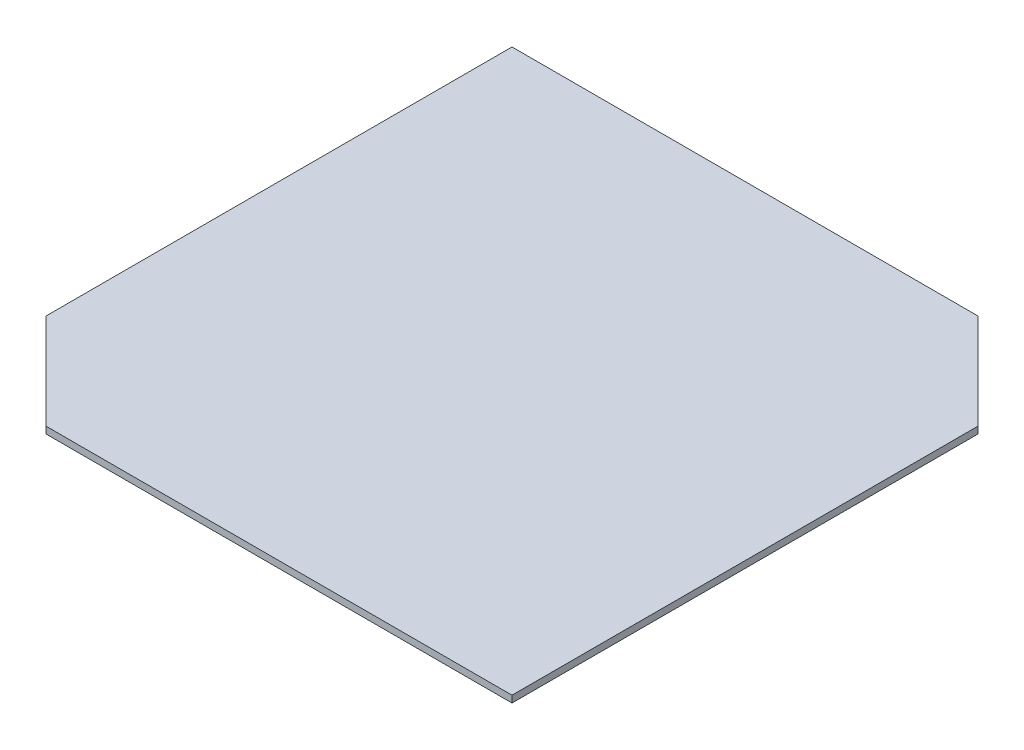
ISO-10303-21;
HEADER;
FILE_DESCRIPTION(('STEP AP214'),'2;1');
FILE_NAME('part.step','',(''),(''),'','','');
FILE_SCHEMA(('AUTOMOTIVE_DESIGN { 1 0 10303 214 1 1 1 1 }'));
ENDSEC;
DATA;
#1=APPLICATION_CONTEXT('core data for automotive mechanical design processes');
#2=APPLICATION_PROTOCOL_DEFINITION('international standard','automotive_design',2000,#1);
#3=PRODUCT_CONTEXT('',#1,'mechanical');
#4=PRODUCT('Part','Part','',(#3));
#5=PRODUCT_RELATED_PRODUCT_CATEGORY('part','',(#4));
#6=PRODUCT_DEFINITION_FORMATION('','',#4);
#7=PRODUCT_DEFINITION_CONTEXT('part definition',#1,'design');
#8=PRODUCT_DEFINITION('design','',#6,#7);
#9=PRODUCT_DEFINITION_SHAPE('','',#8);
#10=(LENGTH_UNIT() NAMED_UNIT(*) SI_UNIT(.MILLI.,.METRE.));
#11=(NAMED_UNIT(*) PLANE_ANGLE_UNIT() SI_UNIT($,.RADIAN.));
#12=(NAMED_UNIT(*) SI_UNIT($,.STERADIAN.) SOLID_ANGLE_UNIT());
#13=UNCERTAINTY_MEASURE_WITH_UNIT(LENGTH_MEASURE(1.E-05),#10,'distance_accuracy_value','');
#14=(GEOMETRIC_REPRESENTATION_CONTEXT(3) GLOBAL_UNCERTAINTY_ASSIGNED_CONTEXT((#13)) GLOBAL_UNIT_ASSIGNED_CONTEXT((#10,
#11,#12)) REPRESENTATION_CONTEXT('',''));
#15=CARTESIAN_POINT('',(0.,0.,0.));
#16=DIRECTION('',(0.,0.,1.));
#17=DIRECTION('',(1.,0.,0.));
#18=AXIS2_PLACEMENT_3D('',#15,#16,#17);
#19=CARTESIAN_POINT('',(-206.,5.,206.));
#20=DIRECTION('',(1.,0.,0.));
#21=DIRECTION('',(0.,0.,-1.));
#22=AXIS2_PLACEMENT_3D('',#19,#20,#21);
#23=PLANE('',#22);
#24=DIRECTION('',(0.,0.,1.));
#25=VECTOR('',#24,1.);
#26=CARTESIAN_POINT('',(-206.,0.,206.));
#27=LINE('',#26,#25);
#28=CARTESIAN_POINT('',(-206.,0.,-206.));
#29=VERTEX_POINT('',#28);
#30=CARTESIAN_POINT('',(-206.,0.,136.));
#31=VERTEX_POINT('',#30);
#32=EDGE_CURVE('E117',#29,#31,#27,.T.);
#33=ORIENTED_EDGE('',*,*,#32,.T.);
#34=DIRECTION('',(0.,1.,0.));
#35=VECTOR('',#34,1.);
#36=CARTESIAN_POINT('',(-206.,5.,136.));
#37=LINE('',#36,#35);
#38=CARTESIAN_POINT('',(-206.,5.,136.));
#39=VERTEX_POINT('',#38);
#40=EDGE_CURVE('E11',#31,#39,#37,.T.);
#41=ORIENTED_EDGE('',*,*,#40,.T.);
#42=DIRECTION('',(0.,0.,1.));
#43=VECTOR('',#42,1.);
#44=CARTESIAN_POINT('',(-206.,5.,206.));
#45=LINE('',#44,#43);
#46=CARTESIAN_POINT('',(-206.,5.,-206.));
#47=VERTEX_POINT('',#46);
#48=EDGE_CURVE('E96',#47,#39,#45,.T.);
#49=ORIENTED_EDGE('',*,*,#48,.F.);
#50=DIRECTION('',(0.,-1.,0.));
#51=VECTOR('',#50,1.);
#52=CARTESIAN_POINT('',(-206.,5.,-206.));
#53=LINE('',#52,#51);
#54=EDGE_CURVE('E107',#47,#29,#53,.T.);
#55=ORIENTED_EDGE('',*,*,#54,.T.);
#56=EDGE_LOOP('',(#33,#41,#49,#55));
#57=FACE_BOUND('',#56,.T.);
#58=ADVANCED_FACE('F36',(#57),#23,.F.);
#59=CARTESIAN_POINT('',(206.,5.,206.));
#60=DIRECTION('',(0.,0.,-1.));
#61=DIRECTION('',(-1.,0.,0.));
#62=AXIS2_PLACEMENT_3D('',#59,#60,#61);
#63=PLANE('',#62);
#64=DIRECTION('',(1.,0.,0.));
#65=VECTOR('',#64,1.);
#66=CARTESIAN_POINT('',(206.,5.,206.));
#67=LINE('',#66,#65);
#68=CARTESIAN_POINT('',(-136.,5.,206.));
#69=VERTEX_POINT('',#68);
#70=CARTESIAN_POINT('',(206.,5.,206.));
#71=VERTEX_POINT('',#70);
#72=EDGE_CURVE('E87',#69,#71,#67,.T.);
#73=ORIENTED_EDGE('',*,*,#72,.F.);
#74=DIRECTION('',(0.,-1.,0.));
#75=VECTOR('',#74,1.);
#76=CARTESIAN_POINT('',(-136.,5.,206.));
#77=LINE('',#76,#75);
#78=CARTESIAN_POINT('',(-136.,0.,206.));
#79=VERTEX_POINT('',#78);
#80=EDGE_CURVE('E44',#69,#79,#77,.T.);
#81=ORIENTED_EDGE('',*,*,#80,.T.);
#82=DIRECTION('',(1.,0.,0.));
#83=VECTOR('',#82,1.);
#84=CARTESIAN_POINT('',(206.,0.,206.));
#85=LINE('',#84,#83);
#86=CARTESIAN_POINT('',(206.,0.,206.));
#87=VERTEX_POINT('',#86);
#88=EDGE_CURVE('E102',#79,#87,#85,.T.);
#89=ORIENTED_EDGE('',*,*,#88,.T.);
#90=DIRECTION('',(0.,-1.,0.));
#91=VECTOR('',#90,1.);
#92=CARTESIAN_POINT('',(206.,5.,206.));
#93=LINE('',#92,#91);
#94=EDGE_CURVE('E99',#71,#87,#93,.T.);
#95=ORIENTED_EDGE('',*,*,#94,.F.);
#96=EDGE_LOOP('',(#73,#81,#89,#95));
#97=FACE_BOUND('',#96,.T.);
#98=ADVANCED_FACE('F100',(#97),#63,.F.);
#99=CARTESIAN_POINT('',(206.,5.,206.));
#100=DIRECTION('',(-1.,0.,0.));
#101=DIRECTION('',(0.,0.,1.));
#102=AXIS2_PLACEMENT_3D('',#99,#100,#101);
#103=PLANE('',#102);
#104=DIRECTION('',(0.,0.,-1.));
#105=VECTOR('',#104,1.);
#106=CARTESIAN_POINT('',(206.,0.,206.));
#107=LINE('',#106,#105);
#108=CARTESIAN_POINT('',(206.,0.,-136.));
#109=VERTEX_POINT('',#108);
#110=EDGE_CURVE('E120',#87,#109,#107,.T.);
#111=ORIENTED_EDGE('',*,*,#110,.T.);
#112=DIRECTION('',(0.,1.,0.));
#113=VECTOR('',#112,1.);
#114=CARTESIAN_POINT('',(206.,5.,-136.));
#115=LINE('',#114,#113);
#116=CARTESIAN_POINT('',(206.,5.,-136.));
#117=VERTEX_POINT('',#116);
#118=EDGE_CURVE('E111',#109,#117,#115,.T.);
#119=ORIENTED_EDGE('',*,*,#118,.T.);
#120=DIRECTION('',(0.,0.,-1.));
#121=VECTOR('',#120,1.);
#122=CARTESIAN_POINT('',(206.,5.,206.));
#123=LINE('',#122,#121);
#124=EDGE_CURVE('E91',#71,#117,#123,.T.);
#125=ORIENTED_EDGE('',*,*,#124,.F.);
#126=ORIENTED_EDGE('',*,*,#94,.T.);
#127=EDGE_LOOP('',(#111,#119,#125,#126));
#128=FACE_BOUND('',#127,.T.);
#129=ADVANCED_FACE('F109',(#128),#103,.F.);
#130=CARTESIAN_POINT('',(206.,5.,-206.));
#131=DIRECTION('',(0.,0.,1.));
#132=DIRECTION('',(1.,0.,0.));
#133=AXIS2_PLACEMENT_3D('',#130,#131,#132);
#134=PLANE('',#133);
#135=DIRECTION('',(-1.,0.,0.));
#136=VECTOR('',#135,1.);
#137=CARTESIAN_POINT('',(206.,5.,-206.));
#138=LINE('',#137,#136);
#139=CARTESIAN_POINT('',(136.,5.,-206.));
#140=VERTEX_POINT('',#139);
#141=EDGE_CURVE('E112',#140,#47,#138,.T.);
#142=ORIENTED_EDGE('',*,*,#141,.F.);
#143=DIRECTION('',(0.,-1.,0.));
#144=VECTOR('',#143,1.);
#145=CARTESIAN_POINT('',(136.,5.,-206.));
#146=LINE('',#145,#144);
#147=CARTESIAN_POINT('',(136.,0.,-206.));
#148=VERTEX_POINT('',#147);
#149=EDGE_CURVE('E106',#140,#148,#146,.T.);
#150=ORIENTED_EDGE('',*,*,#149,.T.);
#151=DIRECTION('',(-1.,0.,0.));
#152=VECTOR('',#151,1.);
#153=CARTESIAN_POINT('',(206.,0.,-206.));
#154=LINE('',#153,#152);
#155=EDGE_CURVE('E122',#148,#29,#154,.T.);
#156=ORIENTED_EDGE('',*,*,#155,.T.);
#157=ORIENTED_EDGE('',*,*,#54,.F.);
#158=EDGE_LOOP('',(#142,#150,#156,#157));
#159=FACE_BOUND('',#158,.T.);
#160=ADVANCED_FACE('F146',(#159),#134,.F.);
#161=CARTESIAN_POINT('',(0.,5.,0.));
#162=DIRECTION('',(0.,1.,0.));
#163=DIRECTION('',(0.,0.,1.));
#164=AXIS2_PLACEMENT_3D('',#161,#162,#163);
#165=PLANE('',#164);
#166=ORIENTED_EDGE('',*,*,#124,.T.);
#167=DIRECTION('',(0.707106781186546,0.,0.707106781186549));
#168=VECTOR('',#167,1.);
#169=CARTESIAN_POINT('',(171.,5.,-171.));
#170=LINE('',#169,#168);
#171=EDGE_CURVE('E134',#117,#140,#170,.F.);
#172=ORIENTED_EDGE('',*,*,#171,.T.);
#173=ORIENTED_EDGE('',*,*,#141,.T.);
#174=ORIENTED_EDGE('',*,*,#48,.T.);
#175=DIRECTION('',(-0.707106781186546,0.,-0.707106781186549));
#176=VECTOR('',#175,1.);
#177=CARTESIAN_POINT('',(-171.,5.,171.));
#178=LINE('',#177,#176);
#179=EDGE_CURVE('E51',#39,#69,#178,.F.);
#180=ORIENTED_EDGE('',*,*,#179,.T.);
#181=ORIENTED_EDGE('',*,*,#72,.T.);
#182=EDGE_LOOP('',(#166,#172,#173,#174,#180,#181));
#183=FACE_BOUND('',#182,.T.);
#184=ADVANCED_FACE('F89',(#183),#165,.T.);
#185=CARTESIAN_POINT('',(0.,0.,0.));
#186=DIRECTION('',(0.,1.,0.));
#187=DIRECTION('',(0.,0.,1.));
#188=AXIS2_PLACEMENT_3D('',#185,#186,#187);
#189=PLANE('',#188);
#190=ORIENTED_EDGE('',*,*,#155,.F.);
#191=DIRECTION('',(-0.707106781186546,0.,-0.707106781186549));
#192=VECTOR('',#191,1.);
#193=CARTESIAN_POINT('',(136.,0.,-206.));
#194=LINE('',#193,#192);
#195=EDGE_CURVE('E130',#148,#109,#194,.F.);
#196=ORIENTED_EDGE('',*,*,#195,.T.);
#197=ORIENTED_EDGE('',*,*,#110,.F.);
#198=ORIENTED_EDGE('',*,*,#88,.F.);
#199=DIRECTION('',(0.707106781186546,0.,0.707106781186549));
#200=VECTOR('',#199,1.);
#201=CARTESIAN_POINT('',(-136.,0.,206.));
#202=LINE('',#201,#200);
#203=EDGE_CURVE('E128',#79,#31,#202,.F.);
#204=ORIENTED_EDGE('',*,*,#203,.T.);
#205=ORIENTED_EDGE('',*,*,#32,.F.);
#206=EDGE_LOOP('',(#190,#196,#197,#198,#204,#205));
#207=FACE_BOUND('',#206,.T.);
#208=ADVANCED_FACE('F138',(#207),#189,.F.);
#209=CARTESIAN_POINT('',(136.,5.,-206.));
#210=DIRECTION('',(-0.707106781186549,0.,0.707106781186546));
#211=DIRECTION('',(0.,-1.,0.));
#212=AXIS2_PLACEMENT_3D('',#209,#210,#211);
#213=PLANE('',#212);
#214=ORIENTED_EDGE('',*,*,#171,.F.);
#215=ORIENTED_EDGE('',*,*,#118,.F.);
#216=ORIENTED_EDGE('',*,*,#195,.F.);
#217=ORIENTED_EDGE('',*,*,#149,.F.);
#218=EDGE_LOOP('',(#214,#215,#216,#217));
#219=FACE_BOUND('',#218,.T.);
#220=ADVANCED_FACE('F141',(#219),#213,.F.);
#221=CARTESIAN_POINT('',(-136.,5.,206.));
#222=DIRECTION('',(0.707106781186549,0.,-0.707106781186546));
#223=DIRECTION('',(0.,-1.,0.));
#224=AXIS2_PLACEMENT_3D('',#221,#222,#223);
#225=PLANE('',#224);
#226=ORIENTED_EDGE('',*,*,#179,.F.);
#227=ORIENTED_EDGE('',*,*,#40,.F.);
#228=ORIENTED_EDGE('',*,*,#203,.F.);
#229=ORIENTED_EDGE('',*,*,#80,.F.);
#230=EDGE_LOOP('',(#226,#227,#228,#229));
#231=FACE_BOUND('',#230,.T.);
#232=ADVANCED_FACE('F38',(#231),#225,.F.);
#233=CLOSED_SHELL('',(#58,#98,#129,#160,#184,#208,#220,#232));
#234=MANIFOLD_SOLID_BREP('B2',#233);
#235=ADVANCED_BREP_SHAPE_REPRESENTATION('',(#18,#234),#14);
#236=SHAPE_DEFINITION_REPRESENTATION(#9,#235);
ENDSEC;
END-ISO-10303-21;
